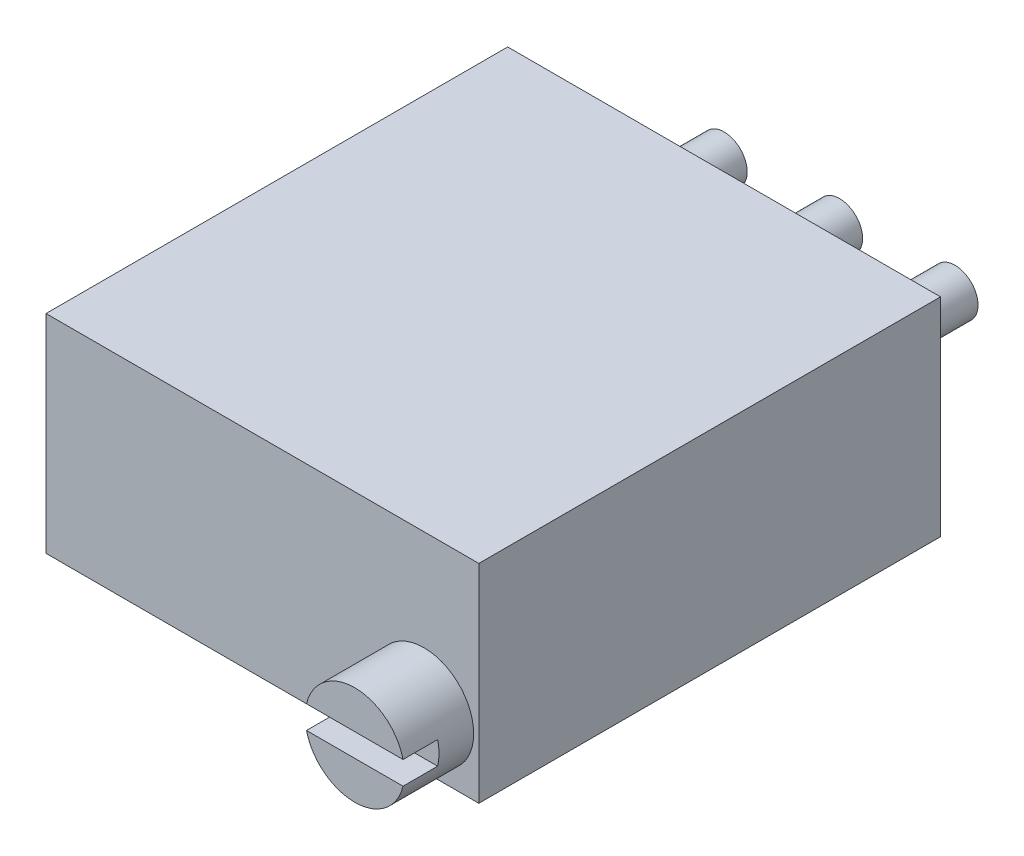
from build123d import *

# Parameters (mm, degrees)
SKETCH1_W             = 9.525
SKETCH1_H             = 4.572
BOSS_EXTRUDE1_DEPTH   = 10.16
SKETCH2_R             = 0.508
BOSS_EXTRUDE2_DEPTH   = 2.54
BOSS_EXTRUDE2_2_DEPTH = 2.54
BOSS_EXTRUDE2_3_DEPTH = 2.54
SKETCH3_R             = 1.0922
BOSS_EXTRUDE3_DEPTH   = 1.524
SKETCH4_W             = 2.1844
SKETCH4_H             = 0.508
CUT_EXTRUDE1_DEPTH    = 0.762


with BuildPart() as part:
    # Sketch1 → Boss-Extrude1 (new body)
    with BuildSketch(Plane.XY):
        Rectangle(SKETCH1_W, SKETCH1_H)
    extrude(amount=BOSS_EXTRUDE1_DEPTH)


with BuildPart() as body_2:
    # Sketch2 → Boss-Extrude2 (new body)
    with BuildSketch(Plane(origin=(0, 0, 0), x_dir=(-1, 0, 0), z_dir=(0, 0, -1))):
        with Locations((2.54, 0)):
            Circle(SKETCH2_R)
    extrude(amount=BOSS_EXTRUDE2_DEPTH)


with BuildPart() as body_3:
    # Sketch2 → Boss-Extrude2 2 (new body)
    with BuildSketch(Plane(origin=(0, 0, 0), x_dir=(-1, 0, 0), z_dir=(0, 0, -1))):
        with Locations((-2.54, 0)):
            Circle(SKETCH2_R)
    extrude(amount=BOSS_EXTRUDE2_2_DEPTH)


with BuildPart() as body_4:
    # Sketch2 → Boss-Extrude2 3 (new body)
    with BuildSketch(Plane(origin=(0, 0, 0), x_dir=(-1, 0, 0), z_dir=(0, 0, -1))):
        Circle(SKETCH2_R)
    extrude(amount=BOSS_EXTRUDE2_3_DEPTH)


with BuildPart() as body_5:
    # Sketch3 → Boss-Extrude3 (new body)
    with BuildSketch(Plane.XY.offset(10.16)):
        with Locations(Location((3.556, -1.016, 0), (0, 0, 180))):
            Circle(SKETCH3_R)
    extrude(amount=BOSS_EXTRUDE3_DEPTH)

    # Sketch4 → Cut-Extrude1 (cut)
    with BuildSketch(Plane.XY.offset(11.684)):
        with Locations((3.556, -1.016)):
            Rectangle(SKETCH4_W, SKETCH4_H)
    extrude(amount=-CUT_EXTRUDE1_DEPTH, mode=Mode.SUBTRACT)


solid = Compound([part.part, body_2.part, body_3.part, body_4.part, body_5.part])
